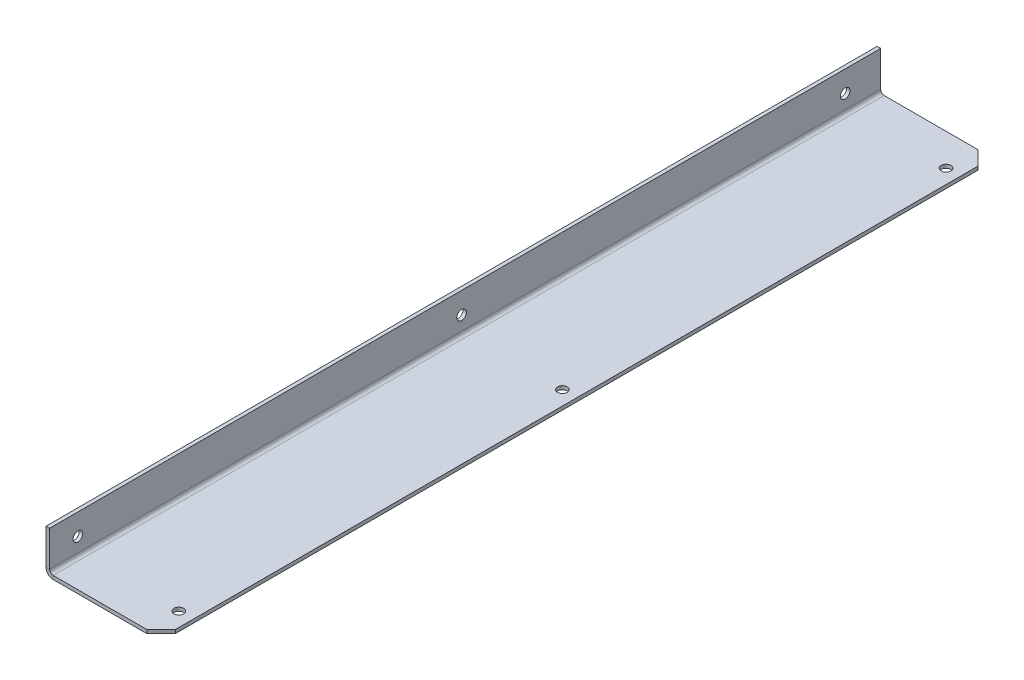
ISO-10303-21;
HEADER;
FILE_DESCRIPTION(('STEP AP214'),'2;1');
FILE_NAME('part.step','',(''),(''),'','','');
FILE_SCHEMA(('AUTOMOTIVE_DESIGN { 1 0 10303 214 1 1 1 1 }'));
ENDSEC;
DATA;
#1=APPLICATION_CONTEXT('core data for automotive mechanical design processes');
#2=APPLICATION_PROTOCOL_DEFINITION('international standard','automotive_design',2000,#1);
#3=PRODUCT_CONTEXT('',#1,'mechanical');
#4=PRODUCT('Part','Part','',(#3));
#5=PRODUCT_RELATED_PRODUCT_CATEGORY('part','',(#4));
#6=PRODUCT_DEFINITION_FORMATION('','',#4);
#7=PRODUCT_DEFINITION_CONTEXT('part definition',#1,'design');
#8=PRODUCT_DEFINITION('design','',#6,#7);
#9=PRODUCT_DEFINITION_SHAPE('','',#8);
#10=(LENGTH_UNIT() NAMED_UNIT(*) SI_UNIT(.MILLI.,.METRE.));
#11=(NAMED_UNIT(*) PLANE_ANGLE_UNIT() SI_UNIT($,.RADIAN.));
#12=(NAMED_UNIT(*) SI_UNIT($,.STERADIAN.) SOLID_ANGLE_UNIT());
#13=UNCERTAINTY_MEASURE_WITH_UNIT(LENGTH_MEASURE(1.E-05),#10,'distance_accuracy_value','');
#14=(GEOMETRIC_REPRESENTATION_CONTEXT(3) GLOBAL_UNCERTAINTY_ASSIGNED_CONTEXT((#13)) GLOBAL_UNIT_ASSIGNED_CONTEXT((#10,
#11,#12)) REPRESENTATION_CONTEXT('',''));
#15=CARTESIAN_POINT('',(0.,0.,0.));
#16=DIRECTION('',(0.,0.,1.));
#17=DIRECTION('',(1.,0.,0.));
#18=AXIS2_PLACEMENT_3D('',#15,#16,#17);
#19=CARTESIAN_POINT('',(-76.,0.,-585.));
#20=DIRECTION('',(0.,0.,-1.));
#21=DIRECTION('',(-1.,0.,0.));
#22=AXIS2_PLACEMENT_3D('',#19,#20,#21);
#23=PLANE('',#22);
#24=DIRECTION('',(0.,1.,0.));
#25=VECTOR('',#24,1.);
#26=CARTESIAN_POINT('',(-76.,0.,-585.));
#27=LINE('',#26,#25);
#28=CARTESIAN_POINT('',(-76.,0.,-585.));
#29=VERTEX_POINT('',#28);
#30=CARTESIAN_POINT('',(-76.,2.49999999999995,-585.));
#31=VERTEX_POINT('',#30);
#32=EDGE_CURVE('E223',#29,#31,#27,.T.);
#33=ORIENTED_EDGE('',*,*,#32,.F.);
#34=CARTESIAN_POINT('',(-76.,5.,-585.));
#35=DIRECTION('',(0.,0.,1.));
#36=DIRECTION('',(1.,0.,0.));
#37=AXIS2_PLACEMENT_3D('',#34,#35,#36);
#38=CIRCLE('',#37,5.);
#39=CARTESIAN_POINT('',(-81.,5.,-585.));
#40=VERTEX_POINT('',#39);
#41=EDGE_CURVE('E179',#29,#40,#38,.F.);
#42=ORIENTED_EDGE('',*,*,#41,.T.);
#43=DIRECTION('',(-1.,0.,0.));
#44=VECTOR('',#43,1.);
#45=CARTESIAN_POINT('',(-78.5,5.,-585.));
#46=LINE('',#45,#44);
#47=CARTESIAN_POINT('',(-78.5,5.,-585.));
#48=VERTEX_POINT('',#47);
#49=EDGE_CURVE('E220',#48,#40,#46,.T.);
#50=ORIENTED_EDGE('',*,*,#49,.F.);
#51=CARTESIAN_POINT('',(-76.,5.,-585.));
#52=DIRECTION('',(0.,0.,1.));
#53=DIRECTION('',(1.,0.,0.));
#54=AXIS2_PLACEMENT_3D('',#51,#52,#53);
#55=CIRCLE('',#54,2.5);
#56=EDGE_CURVE('E129',#31,#48,#55,.F.);
#57=ORIENTED_EDGE('',*,*,#56,.F.);
#58=EDGE_LOOP('',(#33,#42,#50,#57));
#59=FACE_BOUND('',#58,.T.);
#60=ADVANCED_FACE('F40',(#59),#23,.T.);
#61=CARTESIAN_POINT('',(-78.5,5.,-585.));
#62=DIRECTION('',(0.,0.,-1.));
#63=DIRECTION('',(-1.,0.,0.));
#64=AXIS2_PLACEMENT_3D('',#61,#62,#63);
#65=PLANE('',#64);
#66=DIRECTION('',(-1.,0.,0.));
#67=VECTOR('',#66,1.);
#68=CARTESIAN_POINT('',(0.,2.49999999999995,-585.));
#69=LINE('',#68,#67);
#70=CARTESIAN_POINT('',(-10.,2.49999999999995,-585.));
#71=VERTEX_POINT('',#70);
#72=EDGE_CURVE('E186',#71,#31,#69,.T.);
#73=ORIENTED_EDGE('',*,*,#72,.F.);
#74=DIRECTION('',(0.,-1.,0.));
#75=VECTOR('',#74,1.);
#76=CARTESIAN_POINT('',(-10.,0.,-585.));
#77=LINE('',#76,#75);
#78=CARTESIAN_POINT('',(-10.,0.,-585.));
#79=VERTEX_POINT('',#78);
#80=EDGE_CURVE('E251',#71,#79,#77,.T.);
#81=ORIENTED_EDGE('',*,*,#80,.T.);
#82=DIRECTION('',(-1.,0.,0.));
#83=VECTOR('',#82,1.);
#84=CARTESIAN_POINT('',(0.,0.,-585.));
#85=LINE('',#84,#83);
#86=EDGE_CURVE('E183',#79,#29,#85,.T.);
#87=ORIENTED_EDGE('',*,*,#86,.T.);
#88=ORIENTED_EDGE('',*,*,#32,.T.);
#89=EDGE_LOOP('',(#73,#81,#87,#88));
#90=FACE_BOUND('',#89,.T.);
#91=ADVANCED_FACE('F308',(#90),#65,.T.);
#92=CARTESIAN_POINT('',(-81.,5.,0.));
#93=DIRECTION('',(0.,0.,1.));
#94=DIRECTION('',(1.,0.,0.));
#95=AXIS2_PLACEMENT_3D('',#92,#93,#94);
#96=PLANE('',#95);
#97=DIRECTION('',(1.,0.,0.));
#98=VECTOR('',#97,1.);
#99=CARTESIAN_POINT('',(-81.,5.,0.));
#100=LINE('',#99,#98);
#101=CARTESIAN_POINT('',(-81.,5.,0.));
#102=VERTEX_POINT('',#101);
#103=CARTESIAN_POINT('',(-78.5,5.,0.));
#104=VERTEX_POINT('',#103);
#105=EDGE_CURVE('E142',#102,#104,#100,.T.);
#106=ORIENTED_EDGE('',*,*,#105,.F.);
#107=CARTESIAN_POINT('',(-76.,5.,0.));
#108=DIRECTION('',(0.,0.,1.));
#109=DIRECTION('',(1.,0.,0.));
#110=AXIS2_PLACEMENT_3D('',#107,#108,#109);
#111=CIRCLE('',#110,5.);
#112=CARTESIAN_POINT('',(-76.,0.,0.));
#113=VERTEX_POINT('',#112);
#114=EDGE_CURVE('E158',#113,#102,#111,.F.);
#115=ORIENTED_EDGE('',*,*,#114,.F.);
#116=DIRECTION('',(0.,-1.,0.));
#117=VECTOR('',#116,1.);
#118=CARTESIAN_POINT('',(-76.,2.49999999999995,0.));
#119=LINE('',#118,#117);
#120=CARTESIAN_POINT('',(-76.,2.49999999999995,0.));
#121=VERTEX_POINT('',#120);
#122=EDGE_CURVE('E195',#121,#113,#119,.T.);
#123=ORIENTED_EDGE('',*,*,#122,.F.);
#124=CARTESIAN_POINT('',(-76.,5.,0.));
#125=DIRECTION('',(0.,0.,1.));
#126=DIRECTION('',(1.,0.,0.));
#127=AXIS2_PLACEMENT_3D('',#124,#125,#126);
#128=CIRCLE('',#127,2.5);
#129=EDGE_CURVE('E168',#121,#104,#128,.F.);
#130=ORIENTED_EDGE('',*,*,#129,.T.);
#131=EDGE_LOOP('',(#106,#115,#123,#130));
#132=FACE_BOUND('',#131,.T.);
#133=ADVANCED_FACE('F302',(#132),#96,.T.);
#134=CARTESIAN_POINT('',(-76.,2.49999999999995,0.));
#135=DIRECTION('',(0.,0.,1.));
#136=DIRECTION('',(1.,0.,0.));
#137=AXIS2_PLACEMENT_3D('',#134,#135,#136);
#138=PLANE('',#137);
#139=DIRECTION('',(0.,1.,0.));
#140=VECTOR('',#139,1.);
#141=CARTESIAN_POINT('',(-81.,0.,0.));
#142=LINE('',#141,#140);
#143=CARTESIAN_POINT('',(-81.,30.,0.));
#144=VERTEX_POINT('',#143);
#145=EDGE_CURVE('E139',#102,#144,#142,.T.);
#146=ORIENTED_EDGE('',*,*,#145,.F.);
#147=ORIENTED_EDGE('',*,*,#105,.T.);
#148=DIRECTION('',(0.,1.,0.));
#149=VECTOR('',#148,1.);
#150=CARTESIAN_POINT('',(-78.5,0.,0.));
#151=LINE('',#150,#149);
#152=CARTESIAN_POINT('',(-78.5,30.,0.));
#153=VERTEX_POINT('',#152);
#154=EDGE_CURVE('E121',#104,#153,#151,.T.);
#155=ORIENTED_EDGE('',*,*,#154,.T.);
#156=DIRECTION('',(1.,0.,0.));
#157=VECTOR('',#156,1.);
#158=CARTESIAN_POINT('',(-81.,30.,0.));
#159=LINE('',#158,#157);
#160=EDGE_CURVE('E133',#144,#153,#159,.T.);
#161=ORIENTED_EDGE('',*,*,#160,.F.);
#162=EDGE_LOOP('',(#146,#147,#155,#161));
#163=FACE_BOUND('',#162,.T.);
#164=ADVANCED_FACE('F141',(#163),#138,.T.);
#165=CARTESIAN_POINT('',(-78.5,0.,-585.));
#166=DIRECTION('',(1.,0.,0.));
#167=DIRECTION('',(0.,0.,-1.));
#168=AXIS2_PLACEMENT_3D('',#165,#166,#167);
#169=PLANE('',#168);
#170=CARTESIAN_POINT('',(-78.5,15.,-290.));
#171=DIRECTION('',(1.,0.,0.));
#172=DIRECTION('',(0.,0.,-1.));
#173=AXIS2_PLACEMENT_3D('',#170,#171,#172);
#174=CIRCLE('',#173,3.39999999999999);
#175=CARTESIAN_POINT('',(-78.5,15.,-293.4));
#176=VERTEX_POINT('',#175);
#177=EDGE_CURVE('E272',#176,#176,#174,.T.);
#178=ORIENTED_EDGE('',*,*,#177,.F.);
#179=EDGE_LOOP('',(#178));
#180=FACE_BOUND('',#179,.T.);
#181=CARTESIAN_POINT('',(-78.5,15.,-560.));
#182=DIRECTION('',(1.,0.,0.));
#183=DIRECTION('',(0.,0.,-1.));
#184=AXIS2_PLACEMENT_3D('',#181,#182,#183);
#185=CIRCLE('',#184,3.39999999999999);
#186=CARTESIAN_POINT('',(-78.5,15.,-563.4));
#187=VERTEX_POINT('',#186);
#188=EDGE_CURVE('E258',#187,#187,#185,.T.);
#189=ORIENTED_EDGE('',*,*,#188,.F.);
#190=EDGE_LOOP('',(#189));
#191=FACE_BOUND('',#190,.T.);
#192=CARTESIAN_POINT('',(-78.5,15.,-19.9999999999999));
#193=DIRECTION('',(1.,0.,0.));
#194=DIRECTION('',(0.,0.,-1.));
#195=AXIS2_PLACEMENT_3D('',#192,#193,#194);
#196=CIRCLE('',#195,3.39999999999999);
#197=CARTESIAN_POINT('',(-78.5,15.,-23.3999999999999));
#198=VERTEX_POINT('',#197);
#199=EDGE_CURVE('E266',#198,#198,#196,.T.);
#200=ORIENTED_EDGE('',*,*,#199,.F.);
#201=EDGE_LOOP('',(#200));
#202=FACE_BOUND('',#201,.T.);
#203=ORIENTED_EDGE('',*,*,#154,.F.);
#204=DIRECTION('',(0.,0.,1.));
#205=VECTOR('',#204,1.);
#206=CARTESIAN_POINT('',(-78.5,5.,-585.));
#207=LINE('',#206,#205);
#208=EDGE_CURVE('E192',#48,#104,#207,.T.);
#209=ORIENTED_EDGE('',*,*,#208,.F.);
#210=DIRECTION('',(0.,1.,0.));
#211=VECTOR('',#210,1.);
#212=CARTESIAN_POINT('',(-78.5,0.,-585.));
#213=LINE('',#212,#211);
#214=CARTESIAN_POINT('',(-78.5,30.,-585.));
#215=VERTEX_POINT('',#214);
#216=EDGE_CURVE('E124',#48,#215,#213,.T.);
#217=ORIENTED_EDGE('',*,*,#216,.T.);
#218=DIRECTION('',(0.,0.,1.));
#219=VECTOR('',#218,1.);
#220=CARTESIAN_POINT('',(-78.5,30.,-585.));
#221=LINE('',#220,#219);
#222=EDGE_CURVE('E116',#215,#153,#221,.T.);
#223=ORIENTED_EDGE('',*,*,#222,.T.);
#224=EDGE_LOOP('',(#203,#209,#217,#223));
#225=FACE_BOUND('',#224,.T.);
#226=ADVANCED_FACE('F118',(#180,#191,#202,#225),#169,.T.);
#227=CARTESIAN_POINT('',(-76.,5.,-585.));
#228=DIRECTION('',(0.,0.,1.));
#229=DIRECTION('',(1.,0.,0.));
#230=AXIS2_PLACEMENT_3D('',#227,#228,#229);
#231=CYLINDRICAL_SURFACE('',#230,2.5);
#232=ORIENTED_EDGE('',*,*,#129,.F.);
#233=DIRECTION('',(0.,0.,1.));
#234=VECTOR('',#233,1.);
#235=CARTESIAN_POINT('',(-76.,2.49999999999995,-585.));
#236=LINE('',#235,#234);
#237=EDGE_CURVE('E196',#31,#121,#236,.T.);
#238=ORIENTED_EDGE('',*,*,#237,.F.);
#239=ORIENTED_EDGE('',*,*,#56,.T.);
#240=ORIENTED_EDGE('',*,*,#208,.T.);
#241=EDGE_LOOP('',(#232,#238,#239,#240));
#242=FACE_BOUND('',#241,.T.);
#243=ADVANCED_FACE('F292',(#242),#231,.F.);
#244=CARTESIAN_POINT('',(0.,2.49999999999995,-585.));
#245=DIRECTION('',(0.,1.,0.));
#246=DIRECTION('',(-1.,0.,0.));
#247=AXIS2_PLACEMENT_3D('',#244,#245,#246);
#248=PLANE('',#247);
#249=CARTESIAN_POINT('',(-10.,2.49999999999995,-22.5));
#250=DIRECTION('',(0.,1.,0.));
#251=DIRECTION('',(0.,0.,1.));
#252=AXIS2_PLACEMENT_3D('',#249,#250,#251);
#253=CIRCLE('',#252,3.39999999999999);
#254=CARTESIAN_POINT('',(-10.,2.49999999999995,-19.1));
#255=VERTEX_POINT('',#254);
#256=EDGE_CURVE('E237',#255,#255,#253,.T.);
#257=ORIENTED_EDGE('',*,*,#256,.F.);
#258=EDGE_LOOP('',(#257));
#259=FACE_BOUND('',#258,.T.);
#260=CARTESIAN_POINT('',(-10.,2.49999999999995,-292.5));
#261=DIRECTION('',(0.,1.,0.));
#262=DIRECTION('',(0.,0.,1.));
#263=AXIS2_PLACEMENT_3D('',#260,#261,#262);
#264=CIRCLE('',#263,3.39999999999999);
#265=CARTESIAN_POINT('',(-10.,2.49999999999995,-289.1));
#266=VERTEX_POINT('',#265);
#267=EDGE_CURVE('E232',#266,#266,#264,.T.);
#268=ORIENTED_EDGE('',*,*,#267,.F.);
#269=EDGE_LOOP('',(#268));
#270=FACE_BOUND('',#269,.T.);
#271=CARTESIAN_POINT('',(-10.,2.49999999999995,-562.5));
#272=DIRECTION('',(0.,1.,0.));
#273=DIRECTION('',(0.,0.,1.));
#274=AXIS2_PLACEMENT_3D('',#271,#272,#273);
#275=CIRCLE('',#274,3.39999999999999);
#276=CARTESIAN_POINT('',(-10.,2.49999999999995,-559.1));
#277=VERTEX_POINT('',#276);
#278=EDGE_CURVE('E151',#277,#277,#275,.T.);
#279=ORIENTED_EDGE('',*,*,#278,.F.);
#280=EDGE_LOOP('',(#279));
#281=FACE_BOUND('',#280,.T.);
#282=DIRECTION('',(0.,0.,1.));
#283=VECTOR('',#282,1.);
#284=CARTESIAN_POINT('',(0.,2.49999999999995,-585.));
#285=LINE('',#284,#283);
#286=CARTESIAN_POINT('',(0.,2.49999999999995,-575.));
#287=VERTEX_POINT('',#286);
#288=CARTESIAN_POINT('',(0.,2.49999999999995,-10.));
#289=VERTEX_POINT('',#288);
#290=EDGE_CURVE('E200',#287,#289,#285,.T.);
#291=ORIENTED_EDGE('',*,*,#290,.F.);
#292=DIRECTION('',(-0.707106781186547,0.,-0.707106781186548));
#293=VECTOR('',#292,1.);
#294=CARTESIAN_POINT('',(-5.,2.49999999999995,-580.));
#295=LINE('',#294,#293);
#296=EDGE_CURVE('E11',#287,#71,#295,.T.);
#297=ORIENTED_EDGE('',*,*,#296,.T.);
#298=ORIENTED_EDGE('',*,*,#72,.T.);
#299=ORIENTED_EDGE('',*,*,#237,.T.);
#300=DIRECTION('',(-1.,0.,0.));
#301=VECTOR('',#300,1.);
#302=CARTESIAN_POINT('',(0.,2.49999999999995,0.));
#303=LINE('',#302,#301);
#304=CARTESIAN_POINT('',(-9.9999999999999,2.49999999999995,0.));
#305=VERTEX_POINT('',#304);
#306=EDGE_CURVE('E165',#305,#121,#303,.T.);
#307=ORIENTED_EDGE('',*,*,#306,.F.);
#308=DIRECTION('',(0.707106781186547,0.,-0.707106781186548));
#309=VECTOR('',#308,1.);
#310=CARTESIAN_POINT('',(287.5,2.50000000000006,-297.5));
#311=LINE('',#310,#309);
#312=EDGE_CURVE('E247',#305,#289,#311,.T.);
#313=ORIENTED_EDGE('',*,*,#312,.T.);
#314=EDGE_LOOP('',(#291,#297,#298,#299,#307,#313));
#315=FACE_BOUND('',#314,.T.);
#316=ADVANCED_FACE('F299',(#259,#270,#281,#315),#248,.T.);
#317=CARTESIAN_POINT('',(0.,2.49999999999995,-585.));
#318=DIRECTION('',(-1.,0.,0.));
#319=DIRECTION('',(0.,-1.,0.));
#320=AXIS2_PLACEMENT_3D('',#317,#318,#319);
#321=PLANE('',#320);
#322=DIRECTION('',(0.,0.,1.));
#323=VECTOR('',#322,1.);
#324=CARTESIAN_POINT('',(0.,0.,-585.));
#325=LINE('',#324,#323);
#326=CARTESIAN_POINT('',(0.,0.,-575.));
#327=VERTEX_POINT('',#326);
#328=CARTESIAN_POINT('',(0.,0.,-10.));
#329=VERTEX_POINT('',#328);
#330=EDGE_CURVE('E203',#327,#329,#325,.T.);
#331=ORIENTED_EDGE('',*,*,#330,.F.);
#332=DIRECTION('',(0.,1.,0.));
#333=VECTOR('',#332,1.);
#334=CARTESIAN_POINT('',(0.,2.49999999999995,-575.));
#335=LINE('',#334,#333);
#336=EDGE_CURVE('E48',#327,#287,#335,.T.);
#337=ORIENTED_EDGE('',*,*,#336,.T.);
#338=ORIENTED_EDGE('',*,*,#290,.T.);
#339=DIRECTION('',(0.,-1.,0.));
#340=VECTOR('',#339,1.);
#341=CARTESIAN_POINT('',(0.,0.,-10.));
#342=LINE('',#341,#340);
#343=EDGE_CURVE('E226',#289,#329,#342,.T.);
#344=ORIENTED_EDGE('',*,*,#343,.T.);
#345=EDGE_LOOP('',(#331,#337,#338,#344));
#346=FACE_BOUND('',#345,.T.);
#347=ADVANCED_FACE('F378',(#346),#321,.F.);
#348=CARTESIAN_POINT('',(0.,0.,-585.));
#349=DIRECTION('',(0.,1.,0.));
#350=DIRECTION('',(-1.,0.,0.));
#351=AXIS2_PLACEMENT_3D('',#348,#349,#350);
#352=PLANE('',#351);
#353=CARTESIAN_POINT('',(-10.,0.,-22.5));
#354=DIRECTION('',(0.,1.,0.));
#355=DIRECTION('',(-1.,0.,0.));
#356=AXIS2_PLACEMENT_3D('',#353,#354,#355);
#357=CIRCLE('',#356,3.39999999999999);
#358=CARTESIAN_POINT('',(-13.4,0.,-22.5));
#359=VERTEX_POINT('',#358);
#360=EDGE_CURVE('E233',#359,#359,#357,.T.);
#361=ORIENTED_EDGE('',*,*,#360,.T.);
#362=EDGE_LOOP('',(#361));
#363=FACE_BOUND('',#362,.T.);
#364=CARTESIAN_POINT('',(-10.,0.,-292.5));
#365=DIRECTION('',(0.,1.,0.));
#366=DIRECTION('',(-1.,0.,0.));
#367=AXIS2_PLACEMENT_3D('',#364,#365,#366);
#368=CIRCLE('',#367,3.39999999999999);
#369=CARTESIAN_POINT('',(-13.4,0.,-292.5));
#370=VERTEX_POINT('',#369);
#371=EDGE_CURVE('E228',#370,#370,#368,.T.);
#372=ORIENTED_EDGE('',*,*,#371,.T.);
#373=EDGE_LOOP('',(#372));
#374=FACE_BOUND('',#373,.T.);
#375=CARTESIAN_POINT('',(-10.,0.,-562.5));
#376=DIRECTION('',(0.,1.,0.));
#377=DIRECTION('',(-1.,0.,0.));
#378=AXIS2_PLACEMENT_3D('',#375,#376,#377);
#379=CIRCLE('',#378,3.39999999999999);
#380=CARTESIAN_POINT('',(-13.4,0.,-562.5));
#381=VERTEX_POINT('',#380);
#382=EDGE_CURVE('E145',#381,#381,#379,.T.);
#383=ORIENTED_EDGE('',*,*,#382,.T.);
#384=EDGE_LOOP('',(#383));
#385=FACE_BOUND('',#384,.T.);
#386=ORIENTED_EDGE('',*,*,#86,.F.);
#387=DIRECTION('',(0.707106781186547,0.,0.707106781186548));
#388=VECTOR('',#387,1.);
#389=CARTESIAN_POINT('',(-10.,0.,-585.));
#390=LINE('',#389,#388);
#391=EDGE_CURVE('E62',#79,#327,#390,.T.);
#392=ORIENTED_EDGE('',*,*,#391,.T.);
#393=ORIENTED_EDGE('',*,*,#330,.T.);
#394=DIRECTION('',(-0.707106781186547,0.,0.707106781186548));
#395=VECTOR('',#394,1.);
#396=CARTESIAN_POINT('',(0.,0.,-10.));
#397=LINE('',#396,#395);
#398=CARTESIAN_POINT('',(-10.,0.,0.));
#399=VERTEX_POINT('',#398);
#400=EDGE_CURVE('E241',#329,#399,#397,.T.);
#401=ORIENTED_EDGE('',*,*,#400,.T.);
#402=DIRECTION('',(-1.,0.,0.));
#403=VECTOR('',#402,1.);
#404=CARTESIAN_POINT('',(0.,0.,0.));
#405=LINE('',#404,#403);
#406=EDGE_CURVE('E162',#399,#113,#405,.T.);
#407=ORIENTED_EDGE('',*,*,#406,.T.);
#408=DIRECTION('',(0.,0.,1.));
#409=VECTOR('',#408,1.);
#410=CARTESIAN_POINT('',(-76.,0.,-585.));
#411=LINE('',#410,#409);
#412=EDGE_CURVE('E206',#29,#113,#411,.T.);
#413=ORIENTED_EDGE('',*,*,#412,.F.);
#414=EDGE_LOOP('',(#386,#392,#393,#401,#407,#413));
#415=FACE_BOUND('',#414,.T.);
#416=ADVANCED_FACE('F321',(#363,#374,#385,#415),#352,.F.);
#417=CARTESIAN_POINT('',(-76.,5.,-585.));
#418=DIRECTION('',(0.,0.,1.));
#419=DIRECTION('',(1.,0.,0.));
#420=AXIS2_PLACEMENT_3D('',#417,#418,#419);
#421=CYLINDRICAL_SURFACE('',#420,5.);
#422=ORIENTED_EDGE('',*,*,#114,.T.);
#423=DIRECTION('',(0.,0.,1.));
#424=VECTOR('',#423,1.);
#425=CARTESIAN_POINT('',(-81.,5.,-585.));
#426=LINE('',#425,#424);
#427=EDGE_CURVE('E210',#40,#102,#426,.T.);
#428=ORIENTED_EDGE('',*,*,#427,.F.);
#429=ORIENTED_EDGE('',*,*,#41,.F.);
#430=ORIENTED_EDGE('',*,*,#412,.T.);
#431=EDGE_LOOP('',(#422,#428,#429,#430));
#432=FACE_BOUND('',#431,.T.);
#433=ADVANCED_FACE('F325',(#432),#421,.T.);
#434=CARTESIAN_POINT('',(-81.,0.,-585.));
#435=DIRECTION('',(1.,0.,0.));
#436=DIRECTION('',(0.,0.,-1.));
#437=AXIS2_PLACEMENT_3D('',#434,#435,#436);
#438=PLANE('',#437);
#439=CARTESIAN_POINT('',(-81.,15.,-290.));
#440=DIRECTION('',(-1.,0.,0.));
#441=DIRECTION('',(0.,0.,1.));
#442=AXIS2_PLACEMENT_3D('',#439,#440,#441);
#443=CIRCLE('',#442,3.39999999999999);
#444=CARTESIAN_POINT('',(-81.,15.,-286.6));
#445=VERTEX_POINT('',#444);
#446=EDGE_CURVE('E270',#445,#445,#443,.T.);
#447=ORIENTED_EDGE('',*,*,#446,.F.);
#448=EDGE_LOOP('',(#447));
#449=FACE_BOUND('',#448,.T.);
#450=CARTESIAN_POINT('',(-81.,15.,-560.));
#451=DIRECTION('',(-1.,0.,0.));
#452=DIRECTION('',(0.,0.,1.));
#453=AXIS2_PLACEMENT_3D('',#450,#451,#452);
#454=CIRCLE('',#453,3.39999999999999);
#455=CARTESIAN_POINT('',(-81.,15.,-556.6));
#456=VERTEX_POINT('',#455);
#457=EDGE_CURVE('E262',#456,#456,#454,.T.);
#458=ORIENTED_EDGE('',*,*,#457,.F.);
#459=EDGE_LOOP('',(#458));
#460=FACE_BOUND('',#459,.T.);
#461=CARTESIAN_POINT('',(-81.,15.,-19.9999999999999));
#462=DIRECTION('',(-1.,0.,0.));
#463=DIRECTION('',(0.,0.,1.));
#464=AXIS2_PLACEMENT_3D('',#461,#462,#463);
#465=CIRCLE('',#464,3.39999999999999);
#466=CARTESIAN_POINT('',(-81.,15.,-16.5999999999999));
#467=VERTEX_POINT('',#466);
#468=EDGE_CURVE('E261',#467,#467,#465,.T.);
#469=ORIENTED_EDGE('',*,*,#468,.F.);
#470=EDGE_LOOP('',(#469));
#471=FACE_BOUND('',#470,.T.);
#472=ORIENTED_EDGE('',*,*,#145,.T.);
#473=DIRECTION('',(0.,0.,1.));
#474=VECTOR('',#473,1.);
#475=CARTESIAN_POINT('',(-81.,30.,-585.));
#476=LINE('',#475,#474);
#477=CARTESIAN_POINT('',(-81.,30.,-585.));
#478=VERTEX_POINT('',#477);
#479=EDGE_CURVE('E128',#478,#144,#476,.T.);
#480=ORIENTED_EDGE('',*,*,#479,.F.);
#481=DIRECTION('',(0.,1.,0.));
#482=VECTOR('',#481,1.);
#483=CARTESIAN_POINT('',(-81.,0.,-585.));
#484=LINE('',#483,#482);
#485=EDGE_CURVE('E176',#40,#478,#484,.T.);
#486=ORIENTED_EDGE('',*,*,#485,.F.);
#487=ORIENTED_EDGE('',*,*,#427,.T.);
#488=EDGE_LOOP('',(#472,#480,#486,#487));
#489=FACE_BOUND('',#488,.T.);
#490=ADVANCED_FACE('F328',(#449,#460,#471,#489),#438,.F.);
#491=CARTESIAN_POINT('',(-81.,30.,-585.));
#492=DIRECTION('',(0.,-1.,0.));
#493=DIRECTION('',(0.,0.,-1.));
#494=AXIS2_PLACEMENT_3D('',#491,#492,#493);
#495=PLANE('',#494);
#496=ORIENTED_EDGE('',*,*,#160,.T.);
#497=ORIENTED_EDGE('',*,*,#222,.F.);
#498=DIRECTION('',(1.,0.,0.));
#499=VECTOR('',#498,1.);
#500=CARTESIAN_POINT('',(-81.,30.,-585.));
#501=LINE('',#500,#499);
#502=EDGE_CURVE('E173',#478,#215,#501,.T.);
#503=ORIENTED_EDGE('',*,*,#502,.F.);
#504=ORIENTED_EDGE('',*,*,#479,.T.);
#505=EDGE_LOOP('',(#496,#497,#503,#504));
#506=FACE_BOUND('',#505,.T.);
#507=ADVANCED_FACE('F134',(#506),#495,.F.);
#508=CARTESIAN_POINT('',(-76.,5.,-585.));
#509=DIRECTION('',(0.,0.,1.));
#510=DIRECTION('',(1.,0.,0.));
#511=AXIS2_PLACEMENT_3D('',#508,#509,#510);
#512=PLANE('',#511);
#513=ORIENTED_EDGE('',*,*,#216,.F.);
#514=ORIENTED_EDGE('',*,*,#49,.T.);
#515=ORIENTED_EDGE('',*,*,#485,.T.);
#516=ORIENTED_EDGE('',*,*,#502,.T.);
#517=EDGE_LOOP('',(#513,#514,#515,#516));
#518=FACE_BOUND('',#517,.T.);
#519=ADVANCED_FACE('F330',(#518),#512,.F.);
#520=CARTESIAN_POINT('',(-76.,5.,0.));
#521=DIRECTION('',(0.,0.,1.));
#522=DIRECTION('',(1.,0.,0.));
#523=AXIS2_PLACEMENT_3D('',#520,#521,#522);
#524=PLANE('',#523);
#525=ORIENTED_EDGE('',*,*,#406,.F.);
#526=DIRECTION('',(0.,1.,0.));
#527=VECTOR('',#526,1.);
#528=CARTESIAN_POINT('',(-10.,2.49999999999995,0.));
#529=LINE('',#528,#527);
#530=EDGE_CURVE('E244',#399,#305,#529,.T.);
#531=ORIENTED_EDGE('',*,*,#530,.T.);
#532=ORIENTED_EDGE('',*,*,#306,.T.);
#533=ORIENTED_EDGE('',*,*,#122,.T.);
#534=EDGE_LOOP('',(#525,#531,#532,#533));
#535=FACE_BOUND('',#534,.T.);
#536=ADVANCED_FACE('F369',(#535),#524,.T.);
#537=CARTESIAN_POINT('',(-10.,2.49999999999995,-562.5));
#538=DIRECTION('',(0.,1.,0.));
#539=DIRECTION('',(0.,0.,1.));
#540=AXIS2_PLACEMENT_3D('',#537,#538,#539);
#541=CYLINDRICAL_SURFACE('',#540,3.39999999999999);
#542=ORIENTED_EDGE('',*,*,#278,.T.);
#543=EDGE_LOOP('',(#542));
#544=FACE_BOUND('',#543,.T.);
#545=ORIENTED_EDGE('',*,*,#382,.F.);
#546=EDGE_LOOP('',(#545));
#547=FACE_BOUND('',#546,.T.);
#548=ADVANCED_FACE('F365',(#544,#547),#541,.F.);
#549=CARTESIAN_POINT('',(-10.,2.49999999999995,-292.5));
#550=DIRECTION('',(0.,1.,0.));
#551=DIRECTION('',(0.,0.,1.));
#552=AXIS2_PLACEMENT_3D('',#549,#550,#551);
#553=CYLINDRICAL_SURFACE('',#552,3.39999999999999);
#554=ORIENTED_EDGE('',*,*,#267,.T.);
#555=EDGE_LOOP('',(#554));
#556=FACE_BOUND('',#555,.T.);
#557=ORIENTED_EDGE('',*,*,#371,.F.);
#558=EDGE_LOOP('',(#557));
#559=FACE_BOUND('',#558,.T.);
#560=ADVANCED_FACE('F361',(#556,#559),#553,.F.);
#561=CARTESIAN_POINT('',(-10.,2.49999999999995,-22.5));
#562=DIRECTION('',(0.,1.,0.));
#563=DIRECTION('',(0.,0.,1.));
#564=AXIS2_PLACEMENT_3D('',#561,#562,#563);
#565=CYLINDRICAL_SURFACE('',#564,3.39999999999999);
#566=ORIENTED_EDGE('',*,*,#256,.T.);
#567=EDGE_LOOP('',(#566));
#568=FACE_BOUND('',#567,.T.);
#569=ORIENTED_EDGE('',*,*,#360,.F.);
#570=EDGE_LOOP('',(#569));
#571=FACE_BOUND('',#570,.T.);
#572=ADVANCED_FACE('F358',(#568,#571),#565,.F.);
#573=CARTESIAN_POINT('',(-81.,15.,-19.9999999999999));
#574=DIRECTION('',(-1.,0.,0.));
#575=DIRECTION('',(0.,0.,1.));
#576=AXIS2_PLACEMENT_3D('',#573,#574,#575);
#577=CYLINDRICAL_SURFACE('',#576,3.39999999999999);
#578=ORIENTED_EDGE('',*,*,#199,.T.);
#579=EDGE_LOOP('',(#578));
#580=FACE_BOUND('',#579,.T.);
#581=ORIENTED_EDGE('',*,*,#468,.T.);
#582=EDGE_LOOP('',(#581));
#583=FACE_BOUND('',#582,.T.);
#584=ADVANCED_FACE('F288',(#580,#583),#577,.F.);
#585=CARTESIAN_POINT('',(-81.,15.,-560.));
#586=DIRECTION('',(-1.,0.,0.));
#587=DIRECTION('',(0.,0.,1.));
#588=AXIS2_PLACEMENT_3D('',#585,#586,#587);
#589=CYLINDRICAL_SURFACE('',#588,3.39999999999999);
#590=ORIENTED_EDGE('',*,*,#188,.T.);
#591=EDGE_LOOP('',(#590));
#592=FACE_BOUND('',#591,.T.);
#593=ORIENTED_EDGE('',*,*,#457,.T.);
#594=EDGE_LOOP('',(#593));
#595=FACE_BOUND('',#594,.T.);
#596=ADVANCED_FACE('F351',(#592,#595),#589,.F.);
#597=CARTESIAN_POINT('',(-81.,15.,-290.));
#598=DIRECTION('',(-1.,0.,0.));
#599=DIRECTION('',(0.,0.,1.));
#600=AXIS2_PLACEMENT_3D('',#597,#598,#599);
#601=CYLINDRICAL_SURFACE('',#600,3.39999999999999);
#602=ORIENTED_EDGE('',*,*,#177,.T.);
#603=EDGE_LOOP('',(#602));
#604=FACE_BOUND('',#603,.T.);
#605=ORIENTED_EDGE('',*,*,#446,.T.);
#606=EDGE_LOOP('',(#605));
#607=FACE_BOUND('',#606,.T.);
#608=ADVANCED_FACE('F345',(#604,#607),#601,.F.);
#609=CARTESIAN_POINT('',(0.,2.49999999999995,-10.));
#610=DIRECTION('',(0.707106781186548,0.,0.707106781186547));
#611=DIRECTION('',(0.707106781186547,0.,-0.707106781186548));
#612=AXIS2_PLACEMENT_3D('',#609,#610,#611);
#613=PLANE('',#612);
#614=ORIENTED_EDGE('',*,*,#312,.F.);
#615=ORIENTED_EDGE('',*,*,#530,.F.);
#616=ORIENTED_EDGE('',*,*,#400,.F.);
#617=ORIENTED_EDGE('',*,*,#343,.F.);
#618=EDGE_LOOP('',(#614,#615,#616,#617));
#619=FACE_BOUND('',#618,.T.);
#620=ADVANCED_FACE('F340',(#619),#613,.T.);
#621=CARTESIAN_POINT('',(-10.,5.,-585.));
#622=DIRECTION('',(0.707106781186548,0.,-0.707106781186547));
#623=DIRECTION('',(-0.707106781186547,0.,-0.707106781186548));
#624=AXIS2_PLACEMENT_3D('',#621,#622,#623);
#625=PLANE('',#624);
#626=ORIENTED_EDGE('',*,*,#296,.F.);
#627=ORIENTED_EDGE('',*,*,#336,.F.);
#628=ORIENTED_EDGE('',*,*,#391,.F.);
#629=ORIENTED_EDGE('',*,*,#80,.F.);
#630=EDGE_LOOP('',(#626,#627,#628,#629));
#631=FACE_BOUND('',#630,.T.);
#632=ADVANCED_FACE('F338',(#631),#625,.T.);
#633=CLOSED_SHELL('',(#60,#91,#133,#164,#226,#243,#316,#347,#416,#433,#490,#507,#519,#536,#548,
#560,#572,#584,#596,#608,#620,#632));
#634=MANIFOLD_SOLID_BREP('B2',#633);
#635=ADVANCED_BREP_SHAPE_REPRESENTATION('',(#18,#634),#14);
#636=SHAPE_DEFINITION_REPRESENTATION(#9,#635);
ENDSEC;
END-ISO-10303-21;
